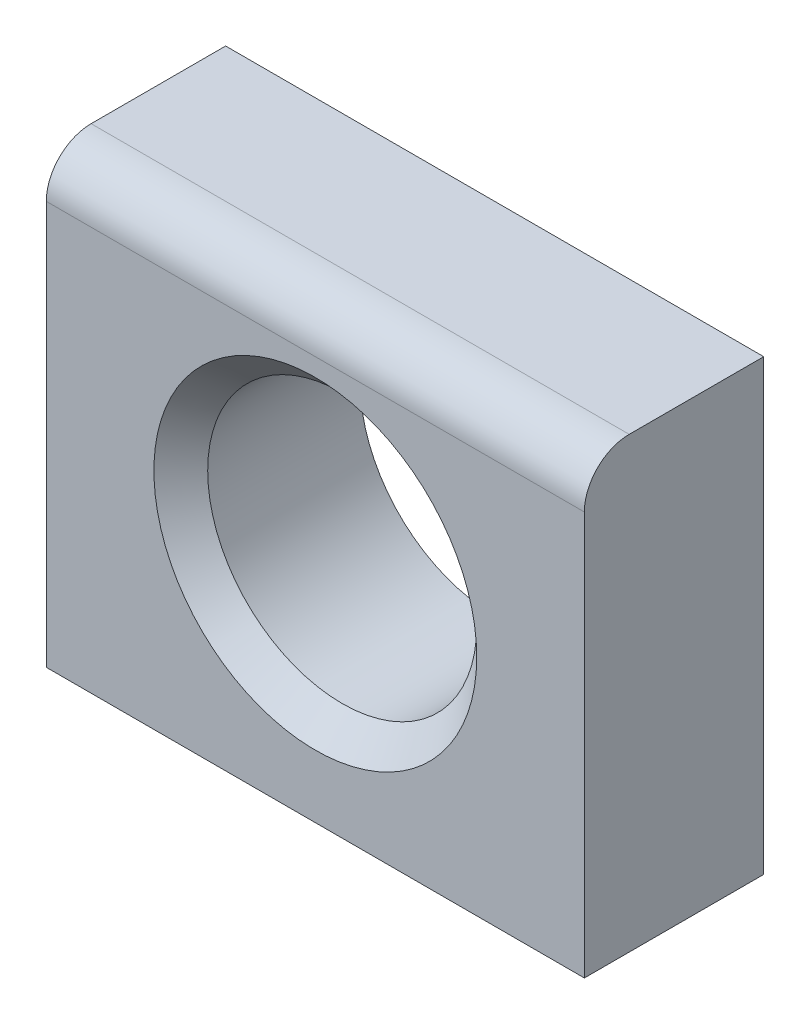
from build123d import *

# Parameters (mm, degrees)
SZKIC1_W                    = 60
SZKIC1_H                    = 50
DODANIE_WYCI_GNI_CIE1_DEPTH = 20
SZKIC_OTWORU_R              = 15
OTW_R_DEPTH                 = 44.874821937
SFAZOWANIE1_SIZE            = 3
ZAOKR_GLENIE1_R             = 5


with BuildPart() as part:
    # Szkic1 → Dodanie-wyci_gni_cie1 (new body)
    with BuildSketch(Plane.XY):
        Rectangle(SZKIC1_W, SZKIC1_H)
    extrude(amount=DODANIE_WYCI_GNI_CIE1_DEPTH)

    # Szkic otworu → Otw_r (cut, through all)
    with BuildSketch(Plane.XY.offset(20)):
        Circle(SZKIC_OTWORU_R)
    extrude(amount=-OTW_R_DEPTH, mode=Mode.SUBTRACT)

    # Sfazowanie1
    sfazowanie1_edges = [part.edges().sort_by_distance(p)[0] for p in [
        (-15, 0, 20),
    ]]
    chamfer(sfazowanie1_edges, length=SFAZOWANIE1_SIZE)

    # Zaokr_glenie1
    zaokr_glenie1_edges = [part.edges().sort_by_distance(p)[0] for p in [
        (0, 25, 20),
    ]]
    fillet(zaokr_glenie1_edges, radius=ZAOKR_GLENIE1_R)


solid = part.part
